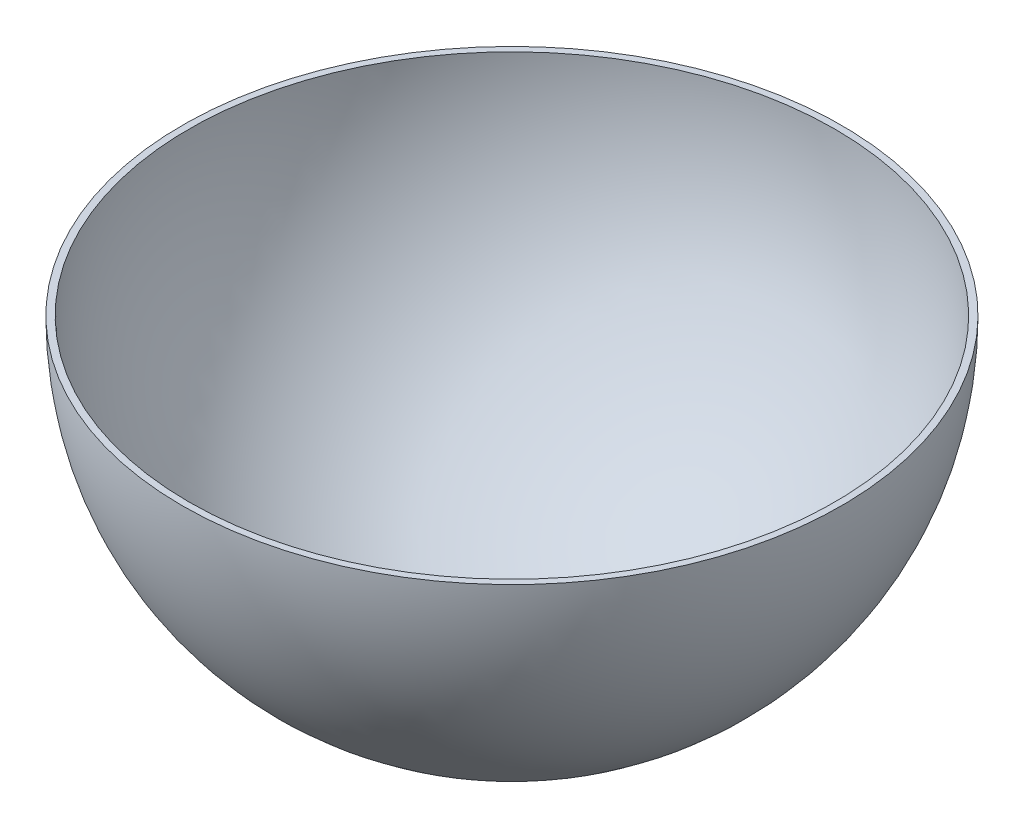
from build123d import *
from build123d.topology import SkipClean

# Parameters (mm, degrees)
SKETCH_2_R          = 100
CUT_EXTRUDE_1_DEPTH = 174.205080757
SKETCH_3_R          = 2.5
CUT_EXTRUDE_2_DEPTH = 174.205080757


with BuildPart() as part:
    # Sketch 1 → Revolve 1 (revolve)
    with BuildSketch(Plane.XY):
        with BuildLine():
            Line((-100, 0), (-98, 0))
            ThreePointArc((-98, 0), (0, -98), (98, 0))
            Line((98, 0), (100, 0))
            ThreePointArc((100, 0), (0, -100), (-100, 0))
        make_face()
    revolve(axis=Axis((-100, 0, 0), (1, 0, 0)))

    # Sketch 2 → Cut-Extrude 1 (cut, through all)
    with SkipClean():  # the faces are left unmerged after this step: merging them gives an invalid solid
        with BuildSketch(Plane(origin=(0, 0, 0), x_dir=(1, 0, 0), z_dir=(0, 1, 0))):
            Circle(SKETCH_2_R)
        extrude(amount=CUT_EXTRUDE_1_DEPTH, mode=Mode.SUBTRACT)

    # Sketch 3 → Cut-Extrude 2 (cut, through all)
    with SkipClean():  # the faces are left unmerged after this step: merging them gives an invalid solid
        with BuildSketch(Plane(origin=(0, 0, 0), x_dir=(1, 0, 0), z_dir=(0, 1, 0))):
            with Locations(Location((0, 0, 0), (0, 0, 270))):
                Circle(SKETCH_3_R)
        extrude(amount=-CUT_EXTRUDE_2_DEPTH, mode=Mode.SUBTRACT)


solid = part.part
